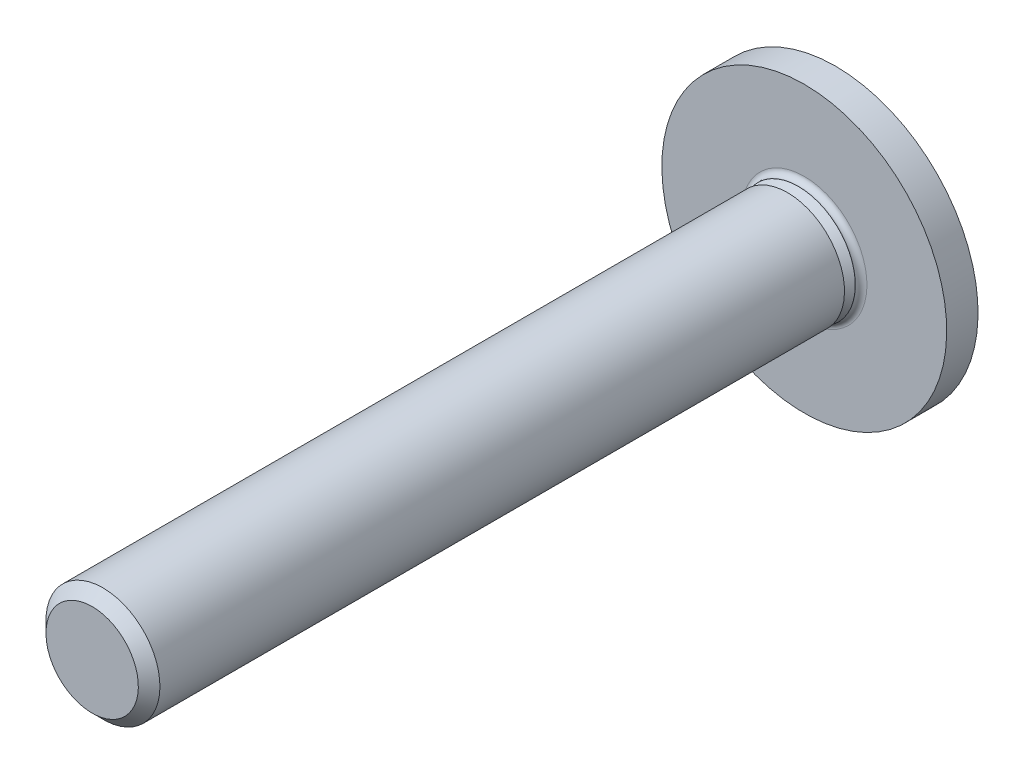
ISO-10303-21;
HEADER;
FILE_DESCRIPTION(('STEP AP214'),'2;1');
FILE_NAME('part.step','',(''),(''),'','','');
FILE_SCHEMA(('AUTOMOTIVE_DESIGN { 1 0 10303 214 1 1 1 1 }'));
ENDSEC;
DATA;
#1=APPLICATION_CONTEXT('core data for automotive mechanical design processes');
#2=APPLICATION_PROTOCOL_DEFINITION('international standard','automotive_design',2000,#1);
#3=PRODUCT_CONTEXT('',#1,'mechanical');
#4=PRODUCT('Part','Part','',(#3));
#5=PRODUCT_RELATED_PRODUCT_CATEGORY('part','',(#4));
#6=PRODUCT_DEFINITION_FORMATION('','',#4);
#7=PRODUCT_DEFINITION_CONTEXT('part definition',#1,'design');
#8=PRODUCT_DEFINITION('design','',#6,#7);
#9=PRODUCT_DEFINITION_SHAPE('','',#8);
#10=(LENGTH_UNIT() NAMED_UNIT(*) SI_UNIT(.MILLI.,.METRE.));
#11=(NAMED_UNIT(*) PLANE_ANGLE_UNIT() SI_UNIT($,.RADIAN.));
#12=(NAMED_UNIT(*) SI_UNIT($,.STERADIAN.) SOLID_ANGLE_UNIT());
#13=UNCERTAINTY_MEASURE_WITH_UNIT(LENGTH_MEASURE(1.E-05),#10,'distance_accuracy_value','');
#14=(GEOMETRIC_REPRESENTATION_CONTEXT(3) GLOBAL_UNCERTAINTY_ASSIGNED_CONTEXT((#13)) GLOBAL_UNIT_ASSIGNED_CONTEXT((#10,
#11,#12)) REPRESENTATION_CONTEXT('',''));
#15=CARTESIAN_POINT('',(0.,0.,0.));
#16=DIRECTION('',(0.,0.,1.));
#17=DIRECTION('',(1.,0.,0.));
#18=AXIS2_PLACEMENT_3D('',#15,#16,#17);
#19=CARTESIAN_POINT('',(0.,0.8105625,28.05));
#20=DIRECTION('',(0.,0.,1.));
#21=DIRECTION('',(0.,1.,0.));
#22=AXIS2_PLACEMENT_3D('',#19,#20,#21);
#23=PLANE('',#22);
#24=CARTESIAN_POINT('',(0.,0.,28.05));
#25=DIRECTION('',(0.,0.,1.));
#26=DIRECTION('',(0.,1.,0.));
#27=AXIS2_PLACEMENT_3D('',#24,#25,#26);
#28=CIRCLE('',#27,1.621125);
#29=CARTESIAN_POINT('',(0.,1.621125,28.05));
#30=VERTEX_POINT('',#29);
#31=EDGE_CURVE('E11',#30,#30,#28,.T.);
#32=ORIENTED_EDGE('',*,*,#31,.T.);
#33=EDGE_LOOP('',(#32));
#34=FACE_BOUND('',#33,.T.);
#35=ADVANCED_FACE('F16',(#34),#23,.T.);
#36=CARTESIAN_POINT('',(0.,0.,27.8605625));
#37=DIRECTION('',(0.,0.,-1.));
#38=DIRECTION('',(0.,1.,0.));
#39=AXIS2_PLACEMENT_3D('',#36,#37,#38);
#40=CONICAL_SURFACE('',#39,1.8105625,0.785398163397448);
#41=CARTESIAN_POINT('',(0.,0.,27.671125));
#42=DIRECTION('',(0.,0.,1.));
#43=DIRECTION('',(0.,1.,0.));
#44=AXIS2_PLACEMENT_3D('',#41,#42,#43);
#45=CIRCLE('',#44,2.);
#46=CARTESIAN_POINT('',(0.,2.,27.671125));
#47=VERTEX_POINT('',#46);
#48=EDGE_CURVE('E26',#47,#47,#45,.T.);
#49=ORIENTED_EDGE('',*,*,#48,.T.);
#50=EDGE_LOOP('',(#49));
#51=FACE_BOUND('',#50,.T.);
#52=ORIENTED_EDGE('',*,*,#31,.F.);
#53=EDGE_LOOP('',(#52));
#54=FACE_BOUND('',#53,.T.);
#55=ADVANCED_FACE('F301',(#51,#54),#40,.T.);
#56=CARTESIAN_POINT('',(0.,0.,15.655));
#57=DIRECTION('',(0.,0.,-1.));
#58=DIRECTION('',(0.,1.,0.));
#59=AXIS2_PLACEMENT_3D('',#56,#57,#58);
#60=CYLINDRICAL_SURFACE('',#59,2.);
#61=CARTESIAN_POINT('',(0.,0.,3.638875));
#62=DIRECTION('',(0.,0.,1.));
#63=DIRECTION('',(0.,1.,0.));
#64=AXIS2_PLACEMENT_3D('',#61,#62,#63);
#65=CIRCLE('',#64,2.);
#66=CARTESIAN_POINT('',(0.,2.,3.638875));
#67=VERTEX_POINT('',#66);
#68=EDGE_CURVE('E211',#67,#67,#65,.T.);
#69=ORIENTED_EDGE('',*,*,#68,.T.);
#70=EDGE_LOOP('',(#69));
#71=FACE_BOUND('',#70,.T.);
#72=ORIENTED_EDGE('',*,*,#48,.F.);
#73=EDGE_LOOP('',(#72));
#74=FACE_BOUND('',#73,.T.);
#75=ADVANCED_FACE('F305',(#71,#74),#60,.T.);
#76=CARTESIAN_POINT('',(0.,1.81056250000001,3.638875));
#77=DIRECTION('',(0.,0.,-1.));
#78=DIRECTION('',(0.,-1.,0.));
#79=AXIS2_PLACEMENT_3D('',#76,#77,#78);
#80=PLANE('',#79);
#81=CARTESIAN_POINT('',(0.,0.,3.638875));
#82=DIRECTION('',(0.,0.,1.));
#83=DIRECTION('',(0.,1.,0.));
#84=AXIS2_PLACEMENT_3D('',#81,#82,#83);
#85=CIRCLE('',#84,1.621125);
#86=CARTESIAN_POINT('',(0.,1.621125,3.638875));
#87=VERTEX_POINT('',#86);
#88=EDGE_CURVE('E209',#87,#87,#85,.T.);
#89=ORIENTED_EDGE('',*,*,#88,.T.);
#90=EDGE_LOOP('',(#89));
#91=FACE_BOUND('',#90,.T.);
#92=ORIENTED_EDGE('',*,*,#68,.F.);
#93=EDGE_LOOP('',(#92));
#94=FACE_BOUND('',#93,.T.);
#95=ADVANCED_FACE('F317',(#91,#94),#80,.T.);
#96=CARTESIAN_POINT('',(0.,0.,3.44943750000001));
#97=DIRECTION('',(0.,0.,-1.));
#98=DIRECTION('',(0.,1.,0.));
#99=AXIS2_PLACEMENT_3D('',#96,#97,#98);
#100=CONICAL_SURFACE('',#99,1.81056250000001,0.785398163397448);
#101=CARTESIAN_POINT('',(0.,0.,3.26));
#102=DIRECTION('',(0.,0.,1.));
#103=DIRECTION('',(0.,1.,0.));
#104=AXIS2_PLACEMENT_3D('',#101,#102,#103);
#105=CIRCLE('',#104,2.);
#106=CARTESIAN_POINT('',(0.,2.,3.26));
#107=VERTEX_POINT('',#106);
#108=EDGE_CURVE('E207',#107,#107,#105,.T.);
#109=ORIENTED_EDGE('',*,*,#108,.T.);
#110=EDGE_LOOP('',(#109));
#111=FACE_BOUND('',#110,.T.);
#112=ORIENTED_EDGE('',*,*,#88,.F.);
#113=EDGE_LOOP('',(#112));
#114=FACE_BOUND('',#113,.T.);
#115=ADVANCED_FACE('F319',(#111,#114),#100,.T.);
#116=CARTESIAN_POINT('',(0.,0.,3.255));
#117=DIRECTION('',(0.,0.,-1.));
#118=DIRECTION('',(0.,1.,0.));
#119=AXIS2_PLACEMENT_3D('',#116,#117,#118);
#120=CYLINDRICAL_SURFACE('',#119,2.);
#121=CARTESIAN_POINT('',(0.,0.,3.25));
#122=DIRECTION('',(0.,0.,1.));
#123=DIRECTION('',(0.,1.,0.));
#124=AXIS2_PLACEMENT_3D('',#121,#122,#123);
#125=CIRCLE('',#124,2.);
#126=CARTESIAN_POINT('',(0.,2.,3.25));
#127=VERTEX_POINT('',#126);
#128=EDGE_CURVE('E20',#127,#127,#125,.T.);
#129=ORIENTED_EDGE('',*,*,#128,.T.);
#130=EDGE_LOOP('',(#129));
#131=FACE_BOUND('',#130,.T.);
#132=ORIENTED_EDGE('',*,*,#108,.F.);
#133=EDGE_LOOP('',(#132));
#134=FACE_BOUND('',#133,.T.);
#135=ADVANCED_FACE('F325',(#131,#134),#120,.T.);
#136=CARTESIAN_POINT('',(0.,0.,3.25));
#137=DIRECTION('',(0.,0.,1.));
#138=DIRECTION('',(1.,0.,0.));
#139=AXIS2_PLACEMENT_3D('',#136,#137,#138);
#140=TOROIDAL_SURFACE('',#139,2.2,0.2);
#141=CARTESIAN_POINT('',(0.,0.,3.05));
#142=DIRECTION('',(0.,0.,1.));
#143=DIRECTION('',(0.,1.,0.));
#144=AXIS2_PLACEMENT_3D('',#141,#142,#143);
#145=CIRCLE('',#144,2.2);
#146=CARTESIAN_POINT('',(0.,2.2,3.05));
#147=VERTEX_POINT('',#146);
#148=EDGE_CURVE('E219',#147,#147,#145,.T.);
#149=ORIENTED_EDGE('',*,*,#148,.T.);
#150=EDGE_LOOP('',(#149));
#151=FACE_BOUND('',#150,.T.);
#152=ORIENTED_EDGE('',*,*,#128,.F.);
#153=EDGE_LOOP('',(#152));
#154=FACE_BOUND('',#153,.T.);
#155=ADVANCED_FACE('F18',(#151,#154),#140,.F.);
#156=CARTESIAN_POINT('',(0.,3.6,3.05));
#157=DIRECTION('',(0.,0.,1.));
#158=DIRECTION('',(0.,1.,0.));
#159=AXIS2_PLACEMENT_3D('',#156,#157,#158);
#160=PLANE('',#159);
#161=CARTESIAN_POINT('',(0.,0.,3.05));
#162=DIRECTION('',(0.,0.,1.));
#163=DIRECTION('',(0.,1.,0.));
#164=AXIS2_PLACEMENT_3D('',#161,#162,#163);
#165=CIRCLE('',#164,5.);
#166=CARTESIAN_POINT('',(0.,5.,3.05));
#167=VERTEX_POINT('',#166);
#168=EDGE_CURVE('E189',#167,#167,#165,.T.);
#169=ORIENTED_EDGE('',*,*,#168,.T.);
#170=EDGE_LOOP('',(#169));
#171=FACE_BOUND('',#170,.T.);
#172=ORIENTED_EDGE('',*,*,#148,.F.);
#173=EDGE_LOOP('',(#172));
#174=FACE_BOUND('',#173,.T.);
#175=ADVANCED_FACE('F340',(#171,#174),#160,.T.);
#176=CARTESIAN_POINT('',(0.,0.,2.5));
#177=DIRECTION('',(0.,0.,-1.));
#178=DIRECTION('',(0.,1.,0.));
#179=AXIS2_PLACEMENT_3D('',#176,#177,#178);
#180=CYLINDRICAL_SURFACE('',#179,5.);
#181=CARTESIAN_POINT('',(0.,0.,1.95));
#182=DIRECTION('',(0.,0.,1.));
#183=DIRECTION('',(0.,1.,0.));
#184=AXIS2_PLACEMENT_3D('',#181,#182,#183);
#185=CIRCLE('',#184,5.);
#186=CARTESIAN_POINT('',(0.,5.,1.95));
#187=VERTEX_POINT('',#186);
#188=EDGE_CURVE('E186',#187,#187,#185,.T.);
#189=ORIENTED_EDGE('',*,*,#188,.T.);
#190=EDGE_LOOP('',(#189));
#191=FACE_BOUND('',#190,.T.);
#192=ORIENTED_EDGE('',*,*,#168,.F.);
#193=EDGE_LOOP('',(#192));
#194=FACE_BOUND('',#193,.T.);
#195=ADVANCED_FACE('F343',(#191,#194),#180,.T.);
#196=CARTESIAN_POINT('',(0.,4.6689571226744,1.95));
#197=DIRECTION('',(0.,0.,-1.));
#198=DIRECTION('',(0.,-1.,0.));
#199=AXIS2_PLACEMENT_3D('',#196,#197,#198);
#200=PLANE('',#199);
#201=CARTESIAN_POINT('',(0.,0.,1.95));
#202=DIRECTION('',(0.,0.,1.));
#203=DIRECTION('',(0.,1.,0.));
#204=AXIS2_PLACEMENT_3D('',#201,#202,#203);
#205=CIRCLE('',#204,4.3379142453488);
#206=CARTESIAN_POINT('',(0.,4.3379142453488,1.95));
#207=VERTEX_POINT('',#206);
#208=EDGE_CURVE('E190',#207,#207,#205,.T.);
#209=ORIENTED_EDGE('',*,*,#208,.T.);
#210=EDGE_LOOP('',(#209));
#211=FACE_BOUND('',#210,.T.);
#212=ORIENTED_EDGE('',*,*,#188,.F.);
#213=EDGE_LOOP('',(#212));
#214=FACE_BOUND('',#213,.T.);
#215=ADVANCED_FACE('F313',(#211,#214),#200,.T.);
#216=CARTESIAN_POINT('',(0.,0.,5.8));
#217=DIRECTION('',(-1.,0.,0.));
#218=DIRECTION('',(0.,0.,1.));
#219=AXIS2_PLACEMENT_3D('',#216,#217,#218);
#220=SPHERICAL_SURFACE('',#219,5.8);
#221=ORIENTED_EDGE('',*,*,#208,.F.);
#222=EDGE_LOOP('',(#221));
#223=FACE_BOUND('',#222,.T.);
#224=CARTESIAN_POINT('',(0.198432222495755,0.0925304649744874,5.74133366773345));
#225=DIRECTION('',(-0.875426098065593,-0.408217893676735,0.258819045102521));
#226=DIRECTION('',(-0.283517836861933,0.,-0.958966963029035));
#227=AXIS2_PLACEMENT_3D('',#224,#225,#226);
#228=CIRCLE('',#227,5.79556908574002);
#229=CARTESIAN_POINT('',(-0.960348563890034,-0.960348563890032,0.161253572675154));
#230=VERTEX_POINT('',#229);
#231=CARTESIAN_POINT('',(-0.308989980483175,-2.18330431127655,0.435514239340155));
#232=VERTEX_POINT('',#231);
#233=EDGE_CURVE('E180',#230,#232,#228,.T.);
#234=ORIENTED_EDGE('',*,*,#233,.T.);
#235=CARTESIAN_POINT('',(0.,-0.695929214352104,5.98647367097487));
#236=DIRECTION('',(0.,-0.965925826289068,0.258819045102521));
#237=DIRECTION('',(0.,0.258819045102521,0.965925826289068));
#238=AXIS2_PLACEMENT_3D('',#235,#236,#237);
#239=CIRCLE('',#238,5.75507689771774);
#240=CARTESIAN_POINT('',(0.308989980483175,-2.18330431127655,0.435514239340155));
#241=VERTEX_POINT('',#240);
#242=EDGE_CURVE('E92',#232,#241,#239,.T.);
#243=ORIENTED_EDGE('',*,*,#242,.T.);
#244=CARTESIAN_POINT('',(-0.198432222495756,0.092530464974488,5.74133366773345));
#245=DIRECTION('',(0.875426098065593,-0.408217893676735,0.258819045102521));
#246=DIRECTION('',(-0.283517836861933,0.,0.958966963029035));
#247=AXIS2_PLACEMENT_3D('',#244,#245,#246);
#248=CIRCLE('',#247,5.79556908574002);
#249=CARTESIAN_POINT('',(0.960348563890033,-0.960348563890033,0.161253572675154));
#250=VERTEX_POINT('',#249);
#251=EDGE_CURVE('E55',#241,#250,#248,.T.);
#252=ORIENTED_EDGE('',*,*,#251,.T.);
#253=CARTESIAN_POINT('',(-0.0925304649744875,0.198432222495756,5.74133366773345));
#254=DIRECTION('',(0.408217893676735,-0.875426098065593,0.258819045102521));
#255=DIRECTION('',(0.,0.283517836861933,0.958966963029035));
#256=AXIS2_PLACEMENT_3D('',#253,#254,#255);
#257=CIRCLE('',#256,5.79556908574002);
#258=CARTESIAN_POINT('',(2.18330431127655,-0.308989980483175,0.435514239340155));
#259=VERTEX_POINT('',#258);
#260=EDGE_CURVE('E199',#250,#259,#257,.T.);
#261=ORIENTED_EDGE('',*,*,#260,.T.);
#262=CARTESIAN_POINT('',(0.695929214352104,0.,5.98647367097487));
#263=DIRECTION('',(0.965925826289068,0.,0.258819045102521));
#264=DIRECTION('',(-0.258819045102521,0.,0.965925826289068));
#265=AXIS2_PLACEMENT_3D('',#262,#263,#264);
#266=CIRCLE('',#265,5.75507689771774);
#267=CARTESIAN_POINT('',(2.18330431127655,0.308989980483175,0.435514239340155));
#268=VERTEX_POINT('',#267);
#269=EDGE_CURVE('E157',#259,#268,#266,.T.);
#270=ORIENTED_EDGE('',*,*,#269,.T.);
#271=CARTESIAN_POINT('',(-0.0925304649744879,-0.198432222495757,5.74133366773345));
#272=DIRECTION('',(0.408217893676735,0.875426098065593,0.258819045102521));
#273=DIRECTION('',(0.,0.283517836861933,-0.958966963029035));
#274=AXIS2_PLACEMENT_3D('',#271,#272,#273);
#275=CIRCLE('',#274,5.79556908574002);
#276=CARTESIAN_POINT('',(0.960348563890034,0.960348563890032,0.161253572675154));
#277=VERTEX_POINT('',#276);
#278=EDGE_CURVE('E184',#268,#277,#275,.T.);
#279=ORIENTED_EDGE('',*,*,#278,.T.);
#280=CARTESIAN_POINT('',(-0.198432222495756,-0.0925304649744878,5.74133366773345));
#281=DIRECTION('',(0.875426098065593,0.408217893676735,0.258819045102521));
#282=DIRECTION('',(-0.283517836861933,0.,0.958966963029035));
#283=AXIS2_PLACEMENT_3D('',#280,#281,#282);
#284=CIRCLE('',#283,5.79556908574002);
#285=CARTESIAN_POINT('',(0.308989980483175,2.18330431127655,0.435514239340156));
#286=VERTEX_POINT('',#285);
#287=EDGE_CURVE('E171',#277,#286,#284,.T.);
#288=ORIENTED_EDGE('',*,*,#287,.T.);
#289=CARTESIAN_POINT('',(0.,0.695929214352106,5.98647367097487));
#290=DIRECTION('',(0.,0.965925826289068,0.258819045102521));
#291=DIRECTION('',(0.,0.258819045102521,-0.965925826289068));
#292=AXIS2_PLACEMENT_3D('',#289,#290,#291);
#293=CIRCLE('',#292,5.75507689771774);
#294=CARTESIAN_POINT('',(-0.308989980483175,2.18330431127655,0.435514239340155));
#295=VERTEX_POINT('',#294);
#296=EDGE_CURVE('E196',#286,#295,#293,.T.);
#297=ORIENTED_EDGE('',*,*,#296,.T.);
#298=CARTESIAN_POINT('',(0.198432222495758,-0.0925304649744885,5.74133366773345));
#299=DIRECTION('',(-0.875426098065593,0.408217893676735,0.258819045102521));
#300=DIRECTION('',(-0.283517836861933,0.,-0.958966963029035));
#301=AXIS2_PLACEMENT_3D('',#298,#299,#300);
#302=CIRCLE('',#301,5.79556908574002);
#303=CARTESIAN_POINT('',(-0.960348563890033,0.960348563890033,0.161253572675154));
#304=VERTEX_POINT('',#303);
#305=EDGE_CURVE('E239',#295,#304,#302,.T.);
#306=ORIENTED_EDGE('',*,*,#305,.T.);
#307=CARTESIAN_POINT('',(0.0925304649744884,-0.198432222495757,5.74133366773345));
#308=DIRECTION('',(-0.408217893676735,0.875426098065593,0.258819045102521));
#309=DIRECTION('',(0.,0.283517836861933,-0.958966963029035));
#310=AXIS2_PLACEMENT_3D('',#307,#308,#309);
#311=CIRCLE('',#310,5.79556908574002);
#312=CARTESIAN_POINT('',(-2.18330431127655,0.308989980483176,0.435514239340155));
#313=VERTEX_POINT('',#312);
#314=EDGE_CURVE('E213',#304,#313,#311,.T.);
#315=ORIENTED_EDGE('',*,*,#314,.T.);
#316=CARTESIAN_POINT('',(-0.695929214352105,0.,5.98647367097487));
#317=DIRECTION('',(-0.965925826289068,0.,0.258819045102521));
#318=DIRECTION('',(-0.258819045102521,0.,-0.965925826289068));
#319=AXIS2_PLACEMENT_3D('',#316,#317,#318);
#320=CIRCLE('',#319,5.75507689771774);
#321=CARTESIAN_POINT('',(-2.18330431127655,-0.308989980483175,0.435514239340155));
#322=VERTEX_POINT('',#321);
#323=EDGE_CURVE('E176',#313,#322,#320,.T.);
#324=ORIENTED_EDGE('',*,*,#323,.T.);
#325=CARTESIAN_POINT('',(0.0925304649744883,0.198432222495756,5.74133366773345));
#326=DIRECTION('',(-0.408217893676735,-0.875426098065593,0.258819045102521));
#327=DIRECTION('',(0.,0.283517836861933,0.958966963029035));
#328=AXIS2_PLACEMENT_3D('',#325,#326,#327);
#329=CIRCLE('',#328,5.79556908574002);
#330=EDGE_CURVE('E214',#322,#230,#329,.T.);
#331=ORIENTED_EDGE('',*,*,#330,.T.);
#332=EDGE_LOOP('',(#234,#243,#252,#261,#270,#279,#288,#297,#306,#315,#324,#331));
#333=FACE_BOUND('',#332,.T.);
#334=ADVANCED_FACE('F261',(#223,#333),#220,.T.);
#335=CARTESIAN_POINT('',(0.,0.,1.8));
#336=DIRECTION('',(0.,0.,1.));
#337=DIRECTION('',(1.,0.,0.));
#338=AXIS2_PLACEMENT_3D('',#335,#336,#337);
#339=PLANE('',#338);
#340=DIRECTION('',(-0.4226182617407,0.90630778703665,0.));
#341=VECTOR('',#340,1.);
#342=CARTESIAN_POINT('',(-0.555741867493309,-0.789029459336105,1.8));
#343=LINE('',#342,#341);
#344=CARTESIAN_POINT('',(-0.076068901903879,-1.81769145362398,1.8));
#345=VERTEX_POINT('',#344);
#346=CARTESIAN_POINT('',(-0.629930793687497,-0.629930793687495,1.8));
#347=VERTEX_POINT('',#346);
#348=EDGE_CURVE('E102',#345,#347,#343,.T.);
#349=ORIENTED_EDGE('',*,*,#348,.T.);
#350=DIRECTION('',(-0.90630778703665,0.422618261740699,0.));
#351=VECTOR('',#350,1.);
#352=CARTESIAN_POINT('',(-2.09616760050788,0.0537866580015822,1.8));
#353=LINE('',#352,#351);
#354=CARTESIAN_POINT('',(-1.81769145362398,-0.0760689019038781,1.8));
#355=VERTEX_POINT('',#354);
#356=EDGE_CURVE('E181',#347,#355,#353,.T.);
#357=ORIENTED_EDGE('',*,*,#356,.T.);
#358=DIRECTION('',(0.,1.,0.));
#359=VECTOR('',#358,1.);
#360=CARTESIAN_POINT('',(-1.81769145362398,0.383333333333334,1.8));
#361=LINE('',#360,#359);
#362=CARTESIAN_POINT('',(-1.81769145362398,0.0760689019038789,1.8));
#363=VERTEX_POINT('',#362);
#364=EDGE_CURVE('E233',#355,#363,#361,.T.);
#365=ORIENTED_EDGE('',*,*,#364,.T.);
#366=DIRECTION('',(0.90630778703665,0.422618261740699,0.));
#367=VECTOR('',#366,1.);
#368=CARTESIAN_POINT('',(-0.789029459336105,0.555741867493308,1.8));
#369=LINE('',#368,#367);
#370=CARTESIAN_POINT('',(-0.629930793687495,0.629930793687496,1.8));
#371=VERTEX_POINT('',#370);
#372=EDGE_CURVE('E195',#363,#371,#369,.T.);
#373=ORIENTED_EDGE('',*,*,#372,.T.);
#374=DIRECTION('',(0.422618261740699,0.90630778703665,0.));
#375=VECTOR('',#374,1.);
#376=CARTESIAN_POINT('',(0.0537866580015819,2.09616760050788,1.8));
#377=LINE('',#376,#375);
#378=CARTESIAN_POINT('',(-0.0760689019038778,1.81769145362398,1.8));
#379=VERTEX_POINT('',#378);
#380=EDGE_CURVE('E229',#371,#379,#377,.T.);
#381=ORIENTED_EDGE('',*,*,#380,.T.);
#382=DIRECTION('',(1.,0.,0.));
#383=VECTOR('',#382,1.);
#384=CARTESIAN_POINT('',(0.383333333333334,1.81769145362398,1.8));
#385=LINE('',#384,#383);
#386=CARTESIAN_POINT('',(0.0760689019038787,1.81769145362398,1.8));
#387=VERTEX_POINT('',#386);
#388=EDGE_CURVE('E163',#379,#387,#385,.T.);
#389=ORIENTED_EDGE('',*,*,#388,.T.);
#390=DIRECTION('',(0.4226182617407,-0.90630778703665,0.));
#391=VECTOR('',#390,1.);
#392=CARTESIAN_POINT('',(0.555741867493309,0.789029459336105,1.8));
#393=LINE('',#392,#391);
#394=CARTESIAN_POINT('',(0.629930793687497,0.629930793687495,1.8));
#395=VERTEX_POINT('',#394);
#396=EDGE_CURVE('E160',#387,#395,#393,.T.);
#397=ORIENTED_EDGE('',*,*,#396,.T.);
#398=DIRECTION('',(0.90630778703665,-0.422618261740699,0.));
#399=VECTOR('',#398,1.);
#400=CARTESIAN_POINT('',(2.09616760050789,-0.0537866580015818,1.8));
#401=LINE('',#400,#399);
#402=CARTESIAN_POINT('',(1.81769145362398,0.0760689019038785,1.8));
#403=VERTEX_POINT('',#402);
#404=EDGE_CURVE('E147',#395,#403,#401,.T.);
#405=ORIENTED_EDGE('',*,*,#404,.T.);
#406=DIRECTION('',(0.,-1.,0.));
#407=VECTOR('',#406,1.);
#408=CARTESIAN_POINT('',(1.81769145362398,-0.383333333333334,1.8));
#409=LINE('',#408,#407);
#410=CARTESIAN_POINT('',(1.81769145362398,-0.0760689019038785,1.8));
#411=VERTEX_POINT('',#410);
#412=EDGE_CURVE('E202',#403,#411,#409,.T.);
#413=ORIENTED_EDGE('',*,*,#412,.T.);
#414=DIRECTION('',(-0.90630778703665,-0.422618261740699,0.));
#415=VECTOR('',#414,1.);
#416=CARTESIAN_POINT('',(0.789029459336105,-0.555741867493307,1.8));
#417=LINE('',#416,#415);
#418=CARTESIAN_POINT('',(0.629930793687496,-0.629930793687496,1.8));
#419=VERTEX_POINT('',#418);
#420=EDGE_CURVE('E205',#411,#419,#417,.T.);
#421=ORIENTED_EDGE('',*,*,#420,.T.);
#422=DIRECTION('',(-0.422618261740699,-0.90630778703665,0.));
#423=VECTOR('',#422,1.);
#424=CARTESIAN_POINT('',(-0.0537866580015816,-2.09616760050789,1.8));
#425=LINE('',#424,#423);
#426=CARTESIAN_POINT('',(0.0760689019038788,-1.81769145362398,1.8));
#427=VERTEX_POINT('',#426);
#428=EDGE_CURVE('E44',#419,#427,#425,.T.);
#429=ORIENTED_EDGE('',*,*,#428,.T.);
#430=DIRECTION('',(-1.,0.,0.));
#431=VECTOR('',#430,1.);
#432=CARTESIAN_POINT('',(-0.383333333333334,-1.81769145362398,1.8));
#433=LINE('',#432,#431);
#434=EDGE_CURVE('E216',#427,#345,#433,.T.);
#435=ORIENTED_EDGE('',*,*,#434,.T.);
#436=EDGE_LOOP('',(#349,#357,#365,#373,#381,#389,#397,#405,#413,#421,#429,#435));
#437=FACE_BOUND('',#436,.T.);
#438=ADVANCED_FACE('F161',(#437),#339,.F.);
#439=CARTESIAN_POINT('',(0.383333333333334,-2.3,0.));
#440=DIRECTION('',(0.,-0.965925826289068,0.258819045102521));
#441=DIRECTION('',(1.,0.,0.));
#442=AXIS2_PLACEMENT_3D('',#439,#440,#441);
#443=PLANE('',#442);
#444=ORIENTED_EDGE('',*,*,#242,.F.);
#445=DIRECTION('',(0.162689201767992,0.255370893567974,0.953057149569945));
#446=VECTOR('',#445,1.);
#447=CARTESIAN_POINT('',(-0.373187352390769,-2.28407400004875,0.0594366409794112));
#448=LINE('',#447,#446);
#449=EDGE_CURVE('E183',#232,#345,#448,.T.);
#450=ORIENTED_EDGE('',*,*,#449,.T.);
#451=ORIENTED_EDGE('',*,*,#434,.F.);
#452=DIRECTION('',(-0.162689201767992,0.255370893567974,0.953057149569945));
#453=VECTOR('',#452,1.);
#454=CARTESIAN_POINT('',(0.364246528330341,-2.27003971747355,0.111813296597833));
#455=LINE('',#454,#453);
#456=EDGE_CURVE('E204',#241,#427,#455,.T.);
#457=ORIENTED_EDGE('',*,*,#456,.F.);
#458=EDGE_LOOP('',(#444,#450,#451,#457));
#459=FACE_BOUND('',#458,.T.);
#460=ADVANCED_FACE('F288',(#459),#443,.F.);
#461=CARTESIAN_POINT('',(0.992861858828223,-0.992861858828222,0.));
#462=DIRECTION('',(0.875426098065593,-0.408217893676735,0.258819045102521));
#463=DIRECTION('',(0.422618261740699,0.90630778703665,0.));
#464=AXIS2_PLACEMENT_3D('',#461,#462,#463);
#465=PLANE('',#464);
#466=ORIENTED_EDGE('',*,*,#251,.F.);
#467=ORIENTED_EDGE('',*,*,#456,.T.);
#468=ORIENTED_EDGE('',*,*,#428,.F.);
#469=DIRECTION('',(-0.193899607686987,0.193899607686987,0.961668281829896));
#470=VECTOR('',#469,1.);
#471=CARTESIAN_POINT('',(1.00597589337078,-1.00597589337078,-0.0650406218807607));
#472=LINE('',#471,#470);
#473=EDGE_CURVE('E201',#250,#419,#472,.T.);
#474=ORIENTED_EDGE('',*,*,#473,.F.);
#475=EDGE_LOOP('',(#466,#467,#468,#474));
#476=FACE_BOUND('',#475,.T.);
#477=ADVANCED_FACE('F259',(#476),#465,.F.);
#478=CARTESIAN_POINT('',(2.3,-0.383333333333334,0.));
#479=DIRECTION('',(0.408217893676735,-0.875426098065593,0.258819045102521));
#480=DIRECTION('',(0.90630778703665,0.422618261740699,0.));
#481=AXIS2_PLACEMENT_3D('',#478,#479,#480);
#482=PLANE('',#481);
#483=ORIENTED_EDGE('',*,*,#260,.F.);
#484=ORIENTED_EDGE('',*,*,#473,.T.);
#485=ORIENTED_EDGE('',*,*,#420,.F.);
#486=DIRECTION('',(-0.255370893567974,0.162689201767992,0.953057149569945));
#487=VECTOR('',#486,1.);
#488=CARTESIAN_POINT('',(2.28407400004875,-0.373187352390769,0.0594366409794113));
#489=LINE('',#488,#487);
#490=EDGE_CURVE('E236',#259,#411,#489,.T.);
#491=ORIENTED_EDGE('',*,*,#490,.F.);
#492=EDGE_LOOP('',(#483,#484,#485,#491));
#493=FACE_BOUND('',#492,.T.);
#494=ADVANCED_FACE('F257',(#493),#482,.F.);
#495=CARTESIAN_POINT('',(2.3,0.383333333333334,0.));
#496=DIRECTION('',(0.965925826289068,0.,0.258819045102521));
#497=DIRECTION('',(0.,1.,0.));
#498=AXIS2_PLACEMENT_3D('',#495,#496,#497);
#499=PLANE('',#498);
#500=ORIENTED_EDGE('',*,*,#269,.F.);
#501=ORIENTED_EDGE('',*,*,#490,.T.);
#502=ORIENTED_EDGE('',*,*,#412,.F.);
#503=DIRECTION('',(-0.255370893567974,-0.162689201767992,0.953057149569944));
#504=VECTOR('',#503,1.);
#505=CARTESIAN_POINT('',(2.27003971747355,0.364246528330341,0.111813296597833));
#506=LINE('',#505,#504);
#507=EDGE_CURVE('E155',#268,#403,#506,.T.);
#508=ORIENTED_EDGE('',*,*,#507,.F.);
#509=EDGE_LOOP('',(#500,#501,#502,#508));
#510=FACE_BOUND('',#509,.T.);
#511=ADVANCED_FACE('F287',(#510),#499,.F.);
#512=CARTESIAN_POINT('',(0.992861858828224,0.992861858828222,0.));
#513=DIRECTION('',(0.408217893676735,0.875426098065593,0.258819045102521));
#514=DIRECTION('',(-0.90630778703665,0.422618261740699,0.));
#515=AXIS2_PLACEMENT_3D('',#512,#513,#514);
#516=PLANE('',#515);
#517=ORIENTED_EDGE('',*,*,#278,.F.);
#518=ORIENTED_EDGE('',*,*,#507,.T.);
#519=ORIENTED_EDGE('',*,*,#404,.F.);
#520=DIRECTION('',(-0.193899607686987,-0.193899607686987,0.961668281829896));
#521=VECTOR('',#520,1.);
#522=CARTESIAN_POINT('',(1.00597589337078,1.00597589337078,-0.0650406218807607));
#523=LINE('',#522,#521);
#524=EDGE_CURVE('E152',#277,#395,#523,.T.);
#525=ORIENTED_EDGE('',*,*,#524,.F.);
#526=EDGE_LOOP('',(#517,#518,#519,#525));
#527=FACE_BOUND('',#526,.T.);
#528=ADVANCED_FACE('F150',(#527),#516,.F.);
#529=CARTESIAN_POINT('',(-0.383333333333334,-2.3,0.));
#530=DIRECTION('',(-0.875426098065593,-0.408217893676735,0.258819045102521));
#531=DIRECTION('',(0.422618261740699,-0.90630778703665,0.));
#532=AXIS2_PLACEMENT_3D('',#529,#530,#531);
#533=PLANE('',#532);
#534=ORIENTED_EDGE('',*,*,#233,.F.);
#535=DIRECTION('',(0.193899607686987,0.193899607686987,0.961668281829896));
#536=VECTOR('',#535,1.);
#537=CARTESIAN_POINT('',(-1.00597589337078,-1.00597589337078,-0.0650406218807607));
#538=LINE('',#537,#536);
#539=EDGE_CURVE('E178',#230,#347,#538,.T.);
#540=ORIENTED_EDGE('',*,*,#539,.T.);
#541=ORIENTED_EDGE('',*,*,#348,.F.);
#542=ORIENTED_EDGE('',*,*,#449,.F.);
#543=EDGE_LOOP('',(#534,#540,#541,#542));
#544=FACE_BOUND('',#543,.T.);
#545=ADVANCED_FACE('F265',(#544),#533,.F.);
#546=CARTESIAN_POINT('',(-0.992861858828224,-0.992861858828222,0.));
#547=DIRECTION('',(-0.408217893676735,-0.875426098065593,0.258819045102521));
#548=DIRECTION('',(0.90630778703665,-0.422618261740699,0.));
#549=AXIS2_PLACEMENT_3D('',#546,#547,#548);
#550=PLANE('',#549);
#551=ORIENTED_EDGE('',*,*,#330,.F.);
#552=DIRECTION('',(0.255370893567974,0.162689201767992,0.953057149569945));
#553=VECTOR('',#552,1.);
#554=CARTESIAN_POINT('',(-2.27003971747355,-0.36424652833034,0.111813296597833));
#555=LINE('',#554,#553);
#556=EDGE_CURVE('E230',#322,#355,#555,.T.);
#557=ORIENTED_EDGE('',*,*,#556,.T.);
#558=ORIENTED_EDGE('',*,*,#356,.F.);
#559=ORIENTED_EDGE('',*,*,#539,.F.);
#560=EDGE_LOOP('',(#551,#557,#558,#559));
#561=FACE_BOUND('',#560,.T.);
#562=ADVANCED_FACE('F268',(#561),#550,.F.);
#563=CARTESIAN_POINT('',(-2.3,-0.383333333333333,0.));
#564=DIRECTION('',(-0.965925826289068,0.,0.258819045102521));
#565=DIRECTION('',(0.,-1.,0.));
#566=AXIS2_PLACEMENT_3D('',#563,#564,#565);
#567=PLANE('',#566);
#568=ORIENTED_EDGE('',*,*,#323,.F.);
#569=DIRECTION('',(0.255370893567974,-0.162689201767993,0.953057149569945));
#570=VECTOR('',#569,1.);
#571=CARTESIAN_POINT('',(-2.28407400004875,0.37318735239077,0.0594366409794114));
#572=LINE('',#571,#570);
#573=EDGE_CURVE('E192',#313,#363,#572,.T.);
#574=ORIENTED_EDGE('',*,*,#573,.T.);
#575=ORIENTED_EDGE('',*,*,#364,.F.);
#576=ORIENTED_EDGE('',*,*,#556,.F.);
#577=EDGE_LOOP('',(#568,#574,#575,#576));
#578=FACE_BOUND('',#577,.T.);
#579=ADVANCED_FACE('F274',(#578),#567,.F.);
#580=CARTESIAN_POINT('',(-2.3,0.383333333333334,0.));
#581=DIRECTION('',(-0.408217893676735,0.875426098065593,0.258819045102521));
#582=DIRECTION('',(-0.90630778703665,-0.422618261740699,0.));
#583=AXIS2_PLACEMENT_3D('',#580,#581,#582);
#584=PLANE('',#583);
#585=ORIENTED_EDGE('',*,*,#314,.F.);
#586=DIRECTION('',(0.193899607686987,-0.193899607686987,0.961668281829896));
#587=VECTOR('',#586,1.);
#588=CARTESIAN_POINT('',(-1.00597589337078,1.00597589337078,-0.0650406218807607));
#589=LINE('',#588,#587);
#590=EDGE_CURVE('E226',#304,#371,#589,.T.);
#591=ORIENTED_EDGE('',*,*,#590,.T.);
#592=ORIENTED_EDGE('',*,*,#372,.F.);
#593=ORIENTED_EDGE('',*,*,#573,.F.);
#594=EDGE_LOOP('',(#585,#591,#592,#593));
#595=FACE_BOUND('',#594,.T.);
#596=ADVANCED_FACE('F277',(#595),#584,.F.);
#597=CARTESIAN_POINT('',(-0.992861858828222,0.992861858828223,0.));
#598=DIRECTION('',(-0.875426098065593,0.408217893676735,0.258819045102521));
#599=DIRECTION('',(-0.422618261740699,-0.90630778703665,0.));
#600=AXIS2_PLACEMENT_3D('',#597,#598,#599);
#601=PLANE('',#600);
#602=ORIENTED_EDGE('',*,*,#305,.F.);
#603=DIRECTION('',(0.162689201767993,-0.255370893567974,0.953057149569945));
#604=VECTOR('',#603,1.);
#605=CARTESIAN_POINT('',(-0.36424652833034,2.27003971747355,0.111813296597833));
#606=LINE('',#605,#604);
#607=EDGE_CURVE('E222',#295,#379,#606,.T.);
#608=ORIENTED_EDGE('',*,*,#607,.T.);
#609=ORIENTED_EDGE('',*,*,#380,.F.);
#610=ORIENTED_EDGE('',*,*,#590,.F.);
#611=EDGE_LOOP('',(#602,#608,#609,#610));
#612=FACE_BOUND('',#611,.T.);
#613=ADVANCED_FACE('F281',(#612),#601,.F.);
#614=CARTESIAN_POINT('',(-0.383333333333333,2.3,0.));
#615=DIRECTION('',(0.,0.965925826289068,0.258819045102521));
#616=DIRECTION('',(-1.,0.,0.));
#617=AXIS2_PLACEMENT_3D('',#614,#615,#616);
#618=PLANE('',#617);
#619=ORIENTED_EDGE('',*,*,#296,.F.);
#620=DIRECTION('',(-0.162689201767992,-0.255370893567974,0.953057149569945));
#621=VECTOR('',#620,1.);
#622=CARTESIAN_POINT('',(0.373187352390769,2.28407400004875,0.0594366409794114));
#623=LINE('',#622,#621);
#624=EDGE_CURVE('E167',#286,#387,#623,.T.);
#625=ORIENTED_EDGE('',*,*,#624,.T.);
#626=ORIENTED_EDGE('',*,*,#388,.F.);
#627=ORIENTED_EDGE('',*,*,#607,.F.);
#628=EDGE_LOOP('',(#619,#625,#626,#627));
#629=FACE_BOUND('',#628,.T.);
#630=ADVANCED_FACE('F284',(#629),#618,.F.);
#631=CARTESIAN_POINT('',(0.383333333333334,2.3,0.));
#632=DIRECTION('',(0.875426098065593,0.408217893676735,0.258819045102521));
#633=DIRECTION('',(-0.422618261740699,0.90630778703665,0.));
#634=AXIS2_PLACEMENT_3D('',#631,#632,#633);
#635=PLANE('',#634);
#636=ORIENTED_EDGE('',*,*,#287,.F.);
#637=ORIENTED_EDGE('',*,*,#524,.T.);
#638=ORIENTED_EDGE('',*,*,#396,.F.);
#639=ORIENTED_EDGE('',*,*,#624,.F.);
#640=EDGE_LOOP('',(#636,#637,#638,#639));
#641=FACE_BOUND('',#640,.T.);
#642=ADVANCED_FACE('F169',(#641),#635,.F.);
#643=CLOSED_SHELL('',(#35,#55,#75,#95,#115,#135,#155,#175,#195,#215,#334,#438,#460,#477,#494,
#511,#528,#545,#562,#579,#596,#613,#630,#642));
#644=MANIFOLD_SOLID_BREP('B1',#643);
#645=ADVANCED_BREP_SHAPE_REPRESENTATION('',(#18,#644),#14);
#646=SHAPE_DEFINITION_REPRESENTATION(#9,#645);
ENDSEC;
END-ISO-10303-21;
